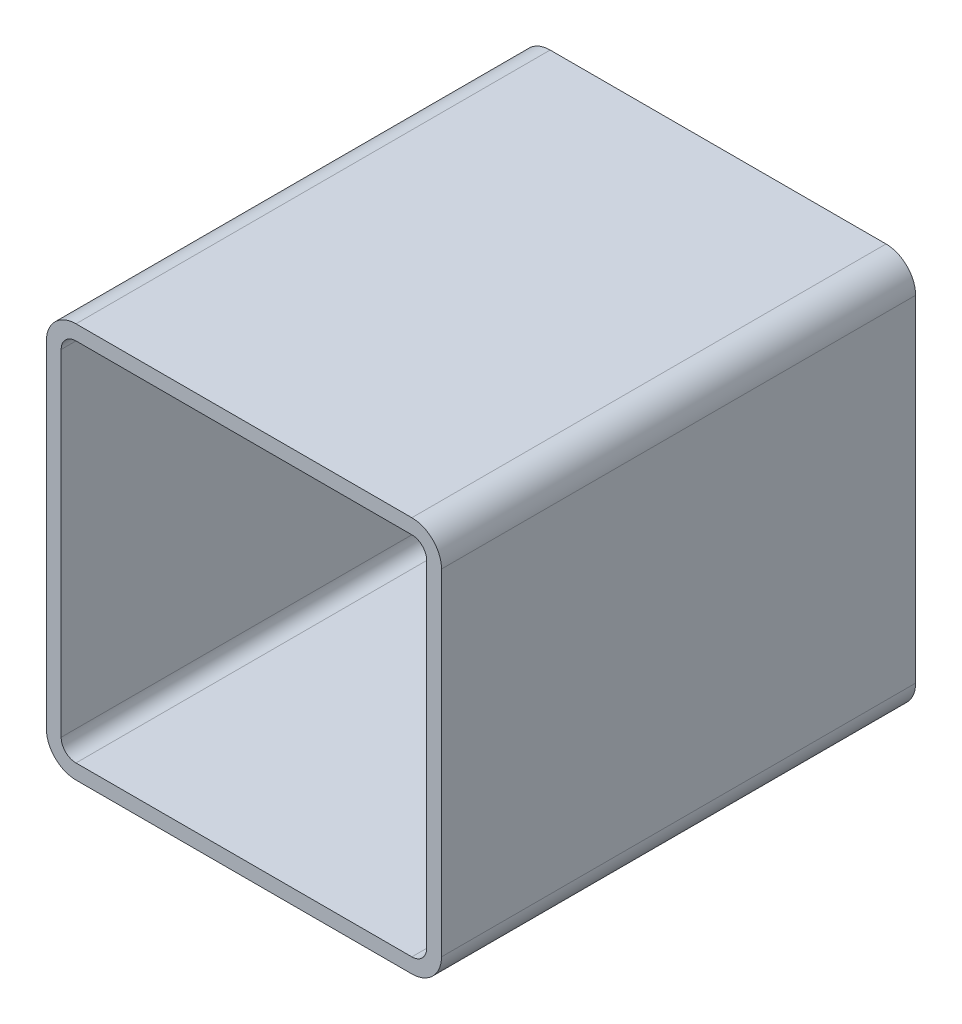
ISO-10303-21;
HEADER;
FILE_DESCRIPTION(('STEP AP214'),'2;1');
FILE_NAME('part.step','',(''),(''),'','','');
FILE_SCHEMA(('AUTOMOTIVE_DESIGN { 1 0 10303 214 1 1 1 1 }'));
ENDSEC;
DATA;
#1=APPLICATION_CONTEXT('core data for automotive mechanical design processes');
#2=APPLICATION_PROTOCOL_DEFINITION('international standard','automotive_design',2000,#1);
#3=PRODUCT_CONTEXT('',#1,'mechanical');
#4=PRODUCT('Part','Part','',(#3));
#5=PRODUCT_RELATED_PRODUCT_CATEGORY('part','',(#4));
#6=PRODUCT_DEFINITION_FORMATION('','',#4);
#7=PRODUCT_DEFINITION_CONTEXT('part definition',#1,'design');
#8=PRODUCT_DEFINITION('design','',#6,#7);
#9=PRODUCT_DEFINITION_SHAPE('','',#8);
#10=(LENGTH_UNIT() NAMED_UNIT(*) SI_UNIT(.MILLI.,.METRE.));
#11=(NAMED_UNIT(*) PLANE_ANGLE_UNIT() SI_UNIT($,.RADIAN.));
#12=(NAMED_UNIT(*) SI_UNIT($,.STERADIAN.) SOLID_ANGLE_UNIT());
#13=UNCERTAINTY_MEASURE_WITH_UNIT(LENGTH_MEASURE(1.E-05),#10,'distance_accuracy_value','');
#14=(GEOMETRIC_REPRESENTATION_CONTEXT(3) GLOBAL_UNCERTAINTY_ASSIGNED_CONTEXT((#13)) GLOBAL_UNIT_ASSIGNED_CONTEXT((#10,
#11,#12)) REPRESENTATION_CONTEXT('',''));
#15=CARTESIAN_POINT('',(0.,0.,0.));
#16=DIRECTION('',(0.,0.,1.));
#17=DIRECTION('',(1.,0.,0.));
#18=AXIS2_PLACEMENT_3D('',#15,#16,#17);
#19=CARTESIAN_POINT('',(21.7845794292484,236.870313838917,304.8));
#20=DIRECTION('',(0.,0.,1.));
#21=DIRECTION('',(1.,0.,0.));
#22=AXIS2_PLACEMENT_3D('',#19,#20,#21);
#23=PLANE('',#22);
#24=CARTESIAN_POINT('',(21.7845794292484,236.870313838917,304.8));
#25=DIRECTION('',(0.,0.,1.));
#26=DIRECTION('',(1.,0.,0.));
#27=AXIS2_PLACEMENT_3D('',#24,#25,#26);
#28=CIRCLE('',#27,19.05);
#29=CARTESIAN_POINT('',(21.7845794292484,255.920313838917,304.8));
#30=VERTEX_POINT('',#29);
#31=CARTESIAN_POINT('',(2.73457942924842,236.870313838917,304.8));
#32=VERTEX_POINT('',#31);
#33=EDGE_CURVE('E211',#30,#32,#28,.T.);
#34=ORIENTED_EDGE('',*,*,#33,.T.);
#35=DIRECTION('',(0.,-1.,0.));
#36=VECTOR('',#35,1.);
#37=CARTESIAN_POINT('',(2.73457942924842,20.9703138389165,304.8));
#38=LINE('',#37,#36);
#39=CARTESIAN_POINT('',(2.73457942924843,20.9703138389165,304.8));
#40=VERTEX_POINT('',#39);
#41=EDGE_CURVE('E214',#32,#40,#38,.T.);
#42=ORIENTED_EDGE('',*,*,#41,.T.);
#43=CARTESIAN_POINT('',(21.7845794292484,20.9703138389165,304.8));
#44=DIRECTION('',(0.,0.,1.));
#45=DIRECTION('',(1.,0.,0.));
#46=AXIS2_PLACEMENT_3D('',#43,#44,#45);
#47=CIRCLE('',#46,19.05);
#48=CARTESIAN_POINT('',(21.7845794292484,1.92031383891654,304.8));
#49=VERTEX_POINT('',#48);
#50=EDGE_CURVE('E217',#40,#49,#47,.T.);
#51=ORIENTED_EDGE('',*,*,#50,.T.);
#52=DIRECTION('',(1.,0.,0.));
#53=VECTOR('',#52,1.);
#54=CARTESIAN_POINT('',(237.684579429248,1.92031383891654,304.8));
#55=LINE('',#54,#53);
#56=CARTESIAN_POINT('',(237.684579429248,1.92031383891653,304.8));
#57=VERTEX_POINT('',#56);
#58=EDGE_CURVE('E219',#49,#57,#55,.T.);
#59=ORIENTED_EDGE('',*,*,#58,.T.);
#60=CARTESIAN_POINT('',(237.684579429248,20.9703138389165,304.8));
#61=DIRECTION('',(0.,0.,1.));
#62=DIRECTION('',(1.,0.,0.));
#63=AXIS2_PLACEMENT_3D('',#60,#61,#62);
#64=CIRCLE('',#63,19.05);
#65=CARTESIAN_POINT('',(256.734579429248,20.9703138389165,304.8));
#66=VERTEX_POINT('',#65);
#67=EDGE_CURVE('E221',#57,#66,#64,.T.);
#68=ORIENTED_EDGE('',*,*,#67,.T.);
#69=DIRECTION('',(0.,1.,0.));
#70=VECTOR('',#69,1.);
#71=CARTESIAN_POINT('',(256.734579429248,236.870313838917,304.8));
#72=LINE('',#71,#70);
#73=CARTESIAN_POINT('',(256.734579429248,236.870313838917,304.8));
#74=VERTEX_POINT('',#73);
#75=EDGE_CURVE('E223',#66,#74,#72,.T.);
#76=ORIENTED_EDGE('',*,*,#75,.T.);
#77=CARTESIAN_POINT('',(237.684579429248,236.870313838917,304.8));
#78=DIRECTION('',(0.,0.,1.));
#79=DIRECTION('',(1.,0.,0.));
#80=AXIS2_PLACEMENT_3D('',#77,#78,#79);
#81=CIRCLE('',#80,19.05);
#82=CARTESIAN_POINT('',(237.684579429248,255.920313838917,304.8));
#83=VERTEX_POINT('',#82);
#84=EDGE_CURVE('E225',#74,#83,#81,.T.);
#85=ORIENTED_EDGE('',*,*,#84,.T.);
#86=DIRECTION('',(-1.,0.,0.));
#87=VECTOR('',#86,1.);
#88=CARTESIAN_POINT('',(21.7845794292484,255.920313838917,304.8));
#89=LINE('',#88,#87);
#90=EDGE_CURVE('E227',#83,#30,#89,.T.);
#91=ORIENTED_EDGE('',*,*,#90,.T.);
#92=EDGE_LOOP('',(#34,#42,#51,#59,#68,#76,#85,#91));
#93=FACE_BOUND('',#92,.T.);
#94=DIRECTION('',(0.,-1.,0.));
#95=VECTOR('',#94,1.);
#96=CARTESIAN_POINT('',(12.2595794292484,20.9703138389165,304.8));
#97=LINE('',#96,#95);
#98=CARTESIAN_POINT('',(12.2595794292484,236.870313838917,304.8));
#99=VERTEX_POINT('',#98);
#100=CARTESIAN_POINT('',(12.2595794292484,20.9703138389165,304.8));
#101=VERTEX_POINT('',#100);
#102=EDGE_CURVE('E154',#99,#101,#97,.T.);
#103=ORIENTED_EDGE('',*,*,#102,.F.);
#104=CARTESIAN_POINT('',(21.7845794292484,236.870313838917,304.8));
#105=DIRECTION('',(0.,0.,1.));
#106=DIRECTION('',(1.,0.,0.));
#107=AXIS2_PLACEMENT_3D('',#104,#105,#106);
#108=CIRCLE('',#107,9.52500000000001);
#109=CARTESIAN_POINT('',(21.7845794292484,246.395313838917,304.8));
#110=VERTEX_POINT('',#109);
#111=EDGE_CURVE('E146',#110,#99,#108,.T.);
#112=ORIENTED_EDGE('',*,*,#111,.F.);
#113=DIRECTION('',(-1.,0.,0.));
#114=VECTOR('',#113,1.);
#115=CARTESIAN_POINT('',(21.7845794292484,246.395313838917,304.8));
#116=LINE('',#115,#114);
#117=CARTESIAN_POINT('',(237.684579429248,246.395313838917,304.8));
#118=VERTEX_POINT('',#117);
#119=EDGE_CURVE('E179',#118,#110,#116,.T.);
#120=ORIENTED_EDGE('',*,*,#119,.F.);
#121=CARTESIAN_POINT('',(237.684579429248,236.870313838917,304.8));
#122=DIRECTION('',(0.,0.,1.));
#123=DIRECTION('',(1.,0.,0.));
#124=AXIS2_PLACEMENT_3D('',#121,#122,#123);
#125=CIRCLE('',#124,9.52500000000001);
#126=CARTESIAN_POINT('',(247.209579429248,236.870313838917,304.8));
#127=VERTEX_POINT('',#126);
#128=EDGE_CURVE('E177',#127,#118,#125,.T.);
#129=ORIENTED_EDGE('',*,*,#128,.F.);
#130=DIRECTION('',(0.,1.,0.));
#131=VECTOR('',#130,1.);
#132=CARTESIAN_POINT('',(247.209579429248,236.870313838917,304.8));
#133=LINE('',#132,#131);
#134=CARTESIAN_POINT('',(247.209579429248,20.9703138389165,304.8));
#135=VERTEX_POINT('',#134);
#136=EDGE_CURVE('E175',#135,#127,#133,.T.);
#137=ORIENTED_EDGE('',*,*,#136,.F.);
#138=CARTESIAN_POINT('',(237.684579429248,20.9703138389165,304.8));
#139=DIRECTION('',(0.,0.,1.));
#140=DIRECTION('',(1.,0.,0.));
#141=AXIS2_PLACEMENT_3D('',#138,#139,#140);
#142=CIRCLE('',#141,9.52500000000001);
#143=CARTESIAN_POINT('',(237.684579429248,11.4453138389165,304.8));
#144=VERTEX_POINT('',#143);
#145=EDGE_CURVE('E173',#144,#135,#142,.T.);
#146=ORIENTED_EDGE('',*,*,#145,.F.);
#147=DIRECTION('',(1.,0.,0.));
#148=VECTOR('',#147,1.);
#149=CARTESIAN_POINT('',(237.684579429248,11.4453138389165,304.8));
#150=LINE('',#149,#148);
#151=CARTESIAN_POINT('',(21.7845794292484,11.4453138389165,304.8));
#152=VERTEX_POINT('',#151);
#153=EDGE_CURVE('E169',#152,#144,#150,.T.);
#154=ORIENTED_EDGE('',*,*,#153,.F.);
#155=CARTESIAN_POINT('',(21.7845794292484,20.9703138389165,304.8));
#156=DIRECTION('',(0.,0.,1.));
#157=DIRECTION('',(1.,0.,0.));
#158=AXIS2_PLACEMENT_3D('',#155,#156,#157);
#159=CIRCLE('',#158,9.525);
#160=EDGE_CURVE('E167',#101,#152,#159,.T.);
#161=ORIENTED_EDGE('',*,*,#160,.F.);
#162=EDGE_LOOP('',(#103,#112,#120,#129,#137,#146,#154,#161));
#163=FACE_BOUND('',#162,.T.);
#164=ADVANCED_FACE('F33',(#93,#163),#23,.T.);
#165=CARTESIAN_POINT('',(21.7845794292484,236.870313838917,0.));
#166=DIRECTION('',(0.,0.,1.));
#167=DIRECTION('',(1.,0.,0.));
#168=AXIS2_PLACEMENT_3D('',#165,#166,#167);
#169=PLANE('',#168);
#170=CARTESIAN_POINT('',(21.7845794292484,236.870313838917,0.));
#171=DIRECTION('',(0.,0.,1.));
#172=DIRECTION('',(1.,0.,0.));
#173=AXIS2_PLACEMENT_3D('',#170,#171,#172);
#174=CIRCLE('',#173,19.05);
#175=CARTESIAN_POINT('',(21.7845794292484,255.920313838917,0.));
#176=VERTEX_POINT('',#175);
#177=CARTESIAN_POINT('',(2.73457942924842,236.870313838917,0.));
#178=VERTEX_POINT('',#177);
#179=EDGE_CURVE('E162',#176,#178,#174,.T.);
#180=ORIENTED_EDGE('',*,*,#179,.F.);
#181=DIRECTION('',(-1.,0.,0.));
#182=VECTOR('',#181,1.);
#183=CARTESIAN_POINT('',(21.7845794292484,255.920313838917,0.));
#184=LINE('',#183,#182);
#185=CARTESIAN_POINT('',(237.684579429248,255.920313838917,0.));
#186=VERTEX_POINT('',#185);
#187=EDGE_CURVE('E215',#186,#176,#184,.T.);
#188=ORIENTED_EDGE('',*,*,#187,.F.);
#189=CARTESIAN_POINT('',(237.684579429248,236.870313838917,0.));
#190=DIRECTION('',(0.,0.,1.));
#191=DIRECTION('',(1.,0.,0.));
#192=AXIS2_PLACEMENT_3D('',#189,#190,#191);
#193=CIRCLE('',#192,19.05);
#194=CARTESIAN_POINT('',(256.734579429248,236.870313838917,0.));
#195=VERTEX_POINT('',#194);
#196=EDGE_CURVE('E242',#195,#186,#193,.T.);
#197=ORIENTED_EDGE('',*,*,#196,.F.);
#198=DIRECTION('',(0.,1.,0.));
#199=VECTOR('',#198,1.);
#200=CARTESIAN_POINT('',(256.734579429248,236.870313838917,0.));
#201=LINE('',#200,#199);
#202=CARTESIAN_POINT('',(256.734579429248,20.9703138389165,0.));
#203=VERTEX_POINT('',#202);
#204=EDGE_CURVE('E240',#203,#195,#201,.T.);
#205=ORIENTED_EDGE('',*,*,#204,.F.);
#206=CARTESIAN_POINT('',(237.684579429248,20.9703138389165,0.));
#207=DIRECTION('',(0.,0.,1.));
#208=DIRECTION('',(1.,0.,0.));
#209=AXIS2_PLACEMENT_3D('',#206,#207,#208);
#210=CIRCLE('',#209,19.05);
#211=CARTESIAN_POINT('',(237.684579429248,1.92031383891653,0.));
#212=VERTEX_POINT('',#211);
#213=EDGE_CURVE('E238',#212,#203,#210,.T.);
#214=ORIENTED_EDGE('',*,*,#213,.F.);
#215=DIRECTION('',(1.,0.,0.));
#216=VECTOR('',#215,1.);
#217=CARTESIAN_POINT('',(237.684579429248,1.92031383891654,0.));
#218=LINE('',#217,#216);
#219=CARTESIAN_POINT('',(21.7845794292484,1.92031383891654,0.));
#220=VERTEX_POINT('',#219);
#221=EDGE_CURVE('E236',#220,#212,#218,.T.);
#222=ORIENTED_EDGE('',*,*,#221,.F.);
#223=CARTESIAN_POINT('',(21.7845794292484,20.9703138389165,0.));
#224=DIRECTION('',(0.,0.,1.));
#225=DIRECTION('',(1.,0.,0.));
#226=AXIS2_PLACEMENT_3D('',#223,#224,#225);
#227=CIRCLE('',#226,19.05);
#228=CARTESIAN_POINT('',(2.73457942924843,20.9703138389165,0.));
#229=VERTEX_POINT('',#228);
#230=EDGE_CURVE('E234',#229,#220,#227,.T.);
#231=ORIENTED_EDGE('',*,*,#230,.F.);
#232=DIRECTION('',(0.,-1.,0.));
#233=VECTOR('',#232,1.);
#234=CARTESIAN_POINT('',(2.73457942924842,20.9703138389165,0.));
#235=LINE('',#234,#233);
#236=EDGE_CURVE('E232',#178,#229,#235,.T.);
#237=ORIENTED_EDGE('',*,*,#236,.F.);
#238=EDGE_LOOP('',(#180,#188,#197,#205,#214,#222,#231,#237));
#239=FACE_BOUND('',#238,.T.);
#240=CARTESIAN_POINT('',(21.7845794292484,236.870313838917,0.));
#241=DIRECTION('',(0.,0.,1.));
#242=DIRECTION('',(1.,0.,0.));
#243=AXIS2_PLACEMENT_3D('',#240,#241,#242);
#244=CIRCLE('',#243,9.52500000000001);
#245=CARTESIAN_POINT('',(21.7845794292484,246.395313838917,0.));
#246=VERTEX_POINT('',#245);
#247=CARTESIAN_POINT('',(12.2595794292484,236.870313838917,0.));
#248=VERTEX_POINT('',#247);
#249=EDGE_CURVE('E56',#246,#248,#244,.T.);
#250=ORIENTED_EDGE('',*,*,#249,.T.);
#251=DIRECTION('',(0.,-1.,0.));
#252=VECTOR('',#251,1.);
#253=CARTESIAN_POINT('',(12.2595794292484,20.9703138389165,0.));
#254=LINE('',#253,#252);
#255=CARTESIAN_POINT('',(12.2595794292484,20.9703138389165,0.));
#256=VERTEX_POINT('',#255);
#257=EDGE_CURVE('E161',#248,#256,#254,.T.);
#258=ORIENTED_EDGE('',*,*,#257,.T.);
#259=CARTESIAN_POINT('',(21.7845794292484,20.9703138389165,0.));
#260=DIRECTION('',(0.,0.,1.));
#261=DIRECTION('',(1.,0.,0.));
#262=AXIS2_PLACEMENT_3D('',#259,#260,#261);
#263=CIRCLE('',#262,9.525);
#264=CARTESIAN_POINT('',(21.7845794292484,11.4453138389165,0.));
#265=VERTEX_POINT('',#264);
#266=EDGE_CURVE('E183',#256,#265,#263,.T.);
#267=ORIENTED_EDGE('',*,*,#266,.T.);
#268=DIRECTION('',(1.,0.,0.));
#269=VECTOR('',#268,1.);
#270=CARTESIAN_POINT('',(237.684579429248,11.4453138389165,0.));
#271=LINE('',#270,#269);
#272=CARTESIAN_POINT('',(237.684579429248,11.4453138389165,0.));
#273=VERTEX_POINT('',#272);
#274=EDGE_CURVE('E186',#265,#273,#271,.T.);
#275=ORIENTED_EDGE('',*,*,#274,.T.);
#276=CARTESIAN_POINT('',(237.684579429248,20.9703138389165,0.));
#277=DIRECTION('',(0.,0.,1.));
#278=DIRECTION('',(1.,0.,0.));
#279=AXIS2_PLACEMENT_3D('',#276,#277,#278);
#280=CIRCLE('',#279,9.52500000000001);
#281=CARTESIAN_POINT('',(247.209579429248,20.9703138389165,0.));
#282=VERTEX_POINT('',#281);
#283=EDGE_CURVE('E189',#273,#282,#280,.T.);
#284=ORIENTED_EDGE('',*,*,#283,.T.);
#285=DIRECTION('',(0.,1.,0.));
#286=VECTOR('',#285,1.);
#287=CARTESIAN_POINT('',(247.209579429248,236.870313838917,0.));
#288=LINE('',#287,#286);
#289=CARTESIAN_POINT('',(247.209579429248,236.870313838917,0.));
#290=VERTEX_POINT('',#289);
#291=EDGE_CURVE('E192',#282,#290,#288,.T.);
#292=ORIENTED_EDGE('',*,*,#291,.T.);
#293=CARTESIAN_POINT('',(237.684579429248,236.870313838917,0.));
#294=DIRECTION('',(0.,0.,1.));
#295=DIRECTION('',(1.,0.,0.));
#296=AXIS2_PLACEMENT_3D('',#293,#294,#295);
#297=CIRCLE('',#296,9.52500000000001);
#298=CARTESIAN_POINT('',(237.684579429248,246.395313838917,0.));
#299=VERTEX_POINT('',#298);
#300=EDGE_CURVE('E195',#290,#299,#297,.T.);
#301=ORIENTED_EDGE('',*,*,#300,.T.);
#302=DIRECTION('',(-1.,0.,0.));
#303=VECTOR('',#302,1.);
#304=CARTESIAN_POINT('',(21.7845794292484,246.395313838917,0.));
#305=LINE('',#304,#303);
#306=EDGE_CURVE('E155',#299,#246,#305,.T.);
#307=ORIENTED_EDGE('',*,*,#306,.T.);
#308=EDGE_LOOP('',(#250,#258,#267,#275,#284,#292,#301,#307));
#309=FACE_BOUND('',#308,.T.);
#310=ADVANCED_FACE('F272',(#239,#309),#169,.F.);
#311=CARTESIAN_POINT('',(21.7845794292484,236.870313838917,304.8));
#312=DIRECTION('',(0.,0.,-1.));
#313=DIRECTION('',(-1.,0.,0.));
#314=AXIS2_PLACEMENT_3D('',#311,#312,#313);
#315=CYLINDRICAL_SURFACE('',#314,19.05);
#316=ORIENTED_EDGE('',*,*,#179,.T.);
#317=DIRECTION('',(0.,0.,-1.));
#318=VECTOR('',#317,1.);
#319=CARTESIAN_POINT('',(2.73457942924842,236.870313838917,304.8));
#320=LINE('',#319,#318);
#321=EDGE_CURVE('E11',#32,#178,#320,.T.);
#322=ORIENTED_EDGE('',*,*,#321,.F.);
#323=ORIENTED_EDGE('',*,*,#33,.F.);
#324=DIRECTION('',(0.,0.,-1.));
#325=VECTOR('',#324,1.);
#326=CARTESIAN_POINT('',(21.7845794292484,255.920313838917,304.8));
#327=LINE('',#326,#325);
#328=EDGE_CURVE('E229',#30,#176,#327,.T.);
#329=ORIENTED_EDGE('',*,*,#328,.T.);
#330=EDGE_LOOP('',(#316,#322,#323,#329));
#331=FACE_BOUND('',#330,.T.);
#332=ADVANCED_FACE('F35',(#331),#315,.T.);
#333=CARTESIAN_POINT('',(2.73457942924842,20.9703138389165,304.8));
#334=DIRECTION('',(1.,0.,0.));
#335=DIRECTION('',(0.,0.,-1.));
#336=AXIS2_PLACEMENT_3D('',#333,#334,#335);
#337=PLANE('',#336);
#338=ORIENTED_EDGE('',*,*,#236,.T.);
#339=DIRECTION('',(0.,0.,-1.));
#340=VECTOR('',#339,1.);
#341=CARTESIAN_POINT('',(2.73457942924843,20.9703138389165,304.8));
#342=LINE('',#341,#340);
#343=EDGE_CURVE('E41',#40,#229,#342,.T.);
#344=ORIENTED_EDGE('',*,*,#343,.F.);
#345=ORIENTED_EDGE('',*,*,#41,.F.);
#346=ORIENTED_EDGE('',*,*,#321,.T.);
#347=EDGE_LOOP('',(#338,#344,#345,#346));
#348=FACE_BOUND('',#347,.T.);
#349=ADVANCED_FACE('F289',(#348),#337,.F.);
#350=CARTESIAN_POINT('',(21.7845794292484,20.9703138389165,304.8));
#351=DIRECTION('',(0.,0.,-1.));
#352=DIRECTION('',(-1.,0.,0.));
#353=AXIS2_PLACEMENT_3D('',#350,#351,#352);
#354=CYLINDRICAL_SURFACE('',#353,19.05);
#355=ORIENTED_EDGE('',*,*,#230,.T.);
#356=DIRECTION('',(0.,0.,-1.));
#357=VECTOR('',#356,1.);
#358=CARTESIAN_POINT('',(21.7845794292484,1.92031383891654,304.8));
#359=LINE('',#358,#357);
#360=EDGE_CURVE('E259',#49,#220,#359,.T.);
#361=ORIENTED_EDGE('',*,*,#360,.F.);
#362=ORIENTED_EDGE('',*,*,#50,.F.);
#363=ORIENTED_EDGE('',*,*,#343,.T.);
#364=EDGE_LOOP('',(#355,#361,#362,#363));
#365=FACE_BOUND('',#364,.T.);
#366=ADVANCED_FACE('F266',(#365),#354,.T.);
#367=CARTESIAN_POINT('',(237.684579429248,1.92031383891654,304.8));
#368=DIRECTION('',(0.,1.,0.));
#369=DIRECTION('',(0.,0.,1.));
#370=AXIS2_PLACEMENT_3D('',#367,#368,#369);
#371=PLANE('',#370);
#372=ORIENTED_EDGE('',*,*,#221,.T.);
#373=DIRECTION('',(0.,0.,-1.));
#374=VECTOR('',#373,1.);
#375=CARTESIAN_POINT('',(237.684579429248,1.92031383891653,304.8));
#376=LINE('',#375,#374);
#377=EDGE_CURVE('E256',#57,#212,#376,.T.);
#378=ORIENTED_EDGE('',*,*,#377,.F.);
#379=ORIENTED_EDGE('',*,*,#58,.F.);
#380=ORIENTED_EDGE('',*,*,#360,.T.);
#381=EDGE_LOOP('',(#372,#378,#379,#380));
#382=FACE_BOUND('',#381,.T.);
#383=ADVANCED_FACE('F278',(#382),#371,.F.);
#384=CARTESIAN_POINT('',(237.684579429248,20.9703138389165,304.8));
#385=DIRECTION('',(0.,0.,-1.));
#386=DIRECTION('',(-1.,0.,0.));
#387=AXIS2_PLACEMENT_3D('',#384,#385,#386);
#388=CYLINDRICAL_SURFACE('',#387,19.05);
#389=ORIENTED_EDGE('',*,*,#213,.T.);
#390=DIRECTION('',(0.,0.,-1.));
#391=VECTOR('',#390,1.);
#392=CARTESIAN_POINT('',(256.734579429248,20.9703138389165,304.8));
#393=LINE('',#392,#391);
#394=EDGE_CURVE('E253',#66,#203,#393,.T.);
#395=ORIENTED_EDGE('',*,*,#394,.F.);
#396=ORIENTED_EDGE('',*,*,#67,.F.);
#397=ORIENTED_EDGE('',*,*,#377,.T.);
#398=EDGE_LOOP('',(#389,#395,#396,#397));
#399=FACE_BOUND('',#398,.T.);
#400=ADVANCED_FACE('F282',(#399),#388,.T.);
#401=CARTESIAN_POINT('',(256.734579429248,236.870313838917,304.8));
#402=DIRECTION('',(-1.,0.,0.));
#403=DIRECTION('',(0.,0.,1.));
#404=AXIS2_PLACEMENT_3D('',#401,#402,#403);
#405=PLANE('',#404);
#406=ORIENTED_EDGE('',*,*,#204,.T.);
#407=DIRECTION('',(0.,0.,-1.));
#408=VECTOR('',#407,1.);
#409=CARTESIAN_POINT('',(256.734579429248,236.870313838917,304.8));
#410=LINE('',#409,#408);
#411=EDGE_CURVE('E250',#74,#195,#410,.T.);
#412=ORIENTED_EDGE('',*,*,#411,.F.);
#413=ORIENTED_EDGE('',*,*,#75,.F.);
#414=ORIENTED_EDGE('',*,*,#394,.T.);
#415=EDGE_LOOP('',(#406,#412,#413,#414));
#416=FACE_BOUND('',#415,.T.);
#417=ADVANCED_FACE('F302',(#416),#405,.F.);
#418=CARTESIAN_POINT('',(237.684579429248,236.870313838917,304.8));
#419=DIRECTION('',(0.,0.,-1.));
#420=DIRECTION('',(-1.,0.,0.));
#421=AXIS2_PLACEMENT_3D('',#418,#419,#420);
#422=CYLINDRICAL_SURFACE('',#421,19.05);
#423=ORIENTED_EDGE('',*,*,#196,.T.);
#424=DIRECTION('',(0.,0.,-1.));
#425=VECTOR('',#424,1.);
#426=CARTESIAN_POINT('',(237.684579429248,255.920313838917,304.8));
#427=LINE('',#426,#425);
#428=EDGE_CURVE('E247',#83,#186,#427,.T.);
#429=ORIENTED_EDGE('',*,*,#428,.F.);
#430=ORIENTED_EDGE('',*,*,#84,.F.);
#431=ORIENTED_EDGE('',*,*,#411,.T.);
#432=EDGE_LOOP('',(#423,#429,#430,#431));
#433=FACE_BOUND('',#432,.T.);
#434=ADVANCED_FACE('F300',(#433),#422,.T.);
#435=CARTESIAN_POINT('',(21.7845794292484,255.920313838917,304.8));
#436=DIRECTION('',(0.,-1.,0.));
#437=DIRECTION('',(0.,0.,-1.));
#438=AXIS2_PLACEMENT_3D('',#435,#436,#437);
#439=PLANE('',#438);
#440=ORIENTED_EDGE('',*,*,#187,.T.);
#441=ORIENTED_EDGE('',*,*,#328,.F.);
#442=ORIENTED_EDGE('',*,*,#90,.F.);
#443=ORIENTED_EDGE('',*,*,#428,.T.);
#444=EDGE_LOOP('',(#440,#441,#442,#443));
#445=FACE_BOUND('',#444,.T.);
#446=ADVANCED_FACE('F295',(#445),#439,.F.);
#447=CARTESIAN_POINT('',(21.7845794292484,236.870313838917,304.8));
#448=DIRECTION('',(0.,0.,-1.));
#449=DIRECTION('',(-1.,0.,0.));
#450=AXIS2_PLACEMENT_3D('',#447,#448,#449);
#451=CYLINDRICAL_SURFACE('',#450,9.52500000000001);
#452=ORIENTED_EDGE('',*,*,#249,.F.);
#453=DIRECTION('',(0.,0.,-1.));
#454=VECTOR('',#453,1.);
#455=CARTESIAN_POINT('',(21.7845794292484,246.395313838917,304.8));
#456=LINE('',#455,#454);
#457=EDGE_CURVE('E150',#110,#246,#456,.T.);
#458=ORIENTED_EDGE('',*,*,#457,.F.);
#459=ORIENTED_EDGE('',*,*,#111,.T.);
#460=DIRECTION('',(0.,0.,-1.));
#461=VECTOR('',#460,1.);
#462=CARTESIAN_POINT('',(12.2595794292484,236.870313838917,304.8));
#463=LINE('',#462,#461);
#464=EDGE_CURVE('E149',#99,#248,#463,.T.);
#465=ORIENTED_EDGE('',*,*,#464,.T.);
#466=EDGE_LOOP('',(#452,#458,#459,#465));
#467=FACE_BOUND('',#466,.T.);
#468=ADVANCED_FACE('F148',(#467),#451,.F.);
#469=CARTESIAN_POINT('',(12.2595794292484,20.9703138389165,304.8));
#470=DIRECTION('',(1.,0.,0.));
#471=DIRECTION('',(0.,0.,-1.));
#472=AXIS2_PLACEMENT_3D('',#469,#470,#471);
#473=PLANE('',#472);
#474=ORIENTED_EDGE('',*,*,#257,.F.);
#475=ORIENTED_EDGE('',*,*,#464,.F.);
#476=ORIENTED_EDGE('',*,*,#102,.T.);
#477=DIRECTION('',(0.,0.,-1.));
#478=VECTOR('',#477,1.);
#479=CARTESIAN_POINT('',(12.2595794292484,20.9703138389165,304.8));
#480=LINE('',#479,#478);
#481=EDGE_CURVE('E163',#101,#256,#480,.T.);
#482=ORIENTED_EDGE('',*,*,#481,.T.);
#483=EDGE_LOOP('',(#474,#475,#476,#482));
#484=FACE_BOUND('',#483,.T.);
#485=ADVANCED_FACE('F158',(#484),#473,.T.);
#486=CARTESIAN_POINT('',(21.7845794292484,20.9703138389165,304.8));
#487=DIRECTION('',(0.,0.,-1.));
#488=DIRECTION('',(-1.,0.,0.));
#489=AXIS2_PLACEMENT_3D('',#486,#487,#488);
#490=CYLINDRICAL_SURFACE('',#489,9.525);
#491=ORIENTED_EDGE('',*,*,#266,.F.);
#492=ORIENTED_EDGE('',*,*,#481,.F.);
#493=ORIENTED_EDGE('',*,*,#160,.T.);
#494=DIRECTION('',(0.,0.,-1.));
#495=VECTOR('',#494,1.);
#496=CARTESIAN_POINT('',(21.7845794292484,11.4453138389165,304.8));
#497=LINE('',#496,#495);
#498=EDGE_CURVE('E208',#152,#265,#497,.T.);
#499=ORIENTED_EDGE('',*,*,#498,.T.);
#500=EDGE_LOOP('',(#491,#492,#493,#499));
#501=FACE_BOUND('',#500,.T.);
#502=ADVANCED_FACE('F327',(#501),#490,.F.);
#503=CARTESIAN_POINT('',(237.684579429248,11.4453138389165,304.8));
#504=DIRECTION('',(0.,1.,0.));
#505=DIRECTION('',(0.,0.,1.));
#506=AXIS2_PLACEMENT_3D('',#503,#504,#505);
#507=PLANE('',#506);
#508=ORIENTED_EDGE('',*,*,#274,.F.);
#509=ORIENTED_EDGE('',*,*,#498,.F.);
#510=ORIENTED_EDGE('',*,*,#153,.T.);
#511=DIRECTION('',(0.,0.,-1.));
#512=VECTOR('',#511,1.);
#513=CARTESIAN_POINT('',(237.684579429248,11.4453138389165,304.8));
#514=LINE('',#513,#512);
#515=EDGE_CURVE('E206',#144,#273,#514,.T.);
#516=ORIENTED_EDGE('',*,*,#515,.T.);
#517=EDGE_LOOP('',(#508,#509,#510,#516));
#518=FACE_BOUND('',#517,.T.);
#519=ADVANCED_FACE('F331',(#518),#507,.T.);
#520=CARTESIAN_POINT('',(237.684579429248,20.9703138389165,304.8));
#521=DIRECTION('',(0.,0.,-1.));
#522=DIRECTION('',(-1.,0.,0.));
#523=AXIS2_PLACEMENT_3D('',#520,#521,#522);
#524=CYLINDRICAL_SURFACE('',#523,9.52500000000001);
#525=ORIENTED_EDGE('',*,*,#283,.F.);
#526=ORIENTED_EDGE('',*,*,#515,.F.);
#527=ORIENTED_EDGE('',*,*,#145,.T.);
#528=DIRECTION('',(0.,0.,-1.));
#529=VECTOR('',#528,1.);
#530=CARTESIAN_POINT('',(247.209579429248,20.9703138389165,304.8));
#531=LINE('',#530,#529);
#532=EDGE_CURVE('E204',#135,#282,#531,.T.);
#533=ORIENTED_EDGE('',*,*,#532,.T.);
#534=EDGE_LOOP('',(#525,#526,#527,#533));
#535=FACE_BOUND('',#534,.T.);
#536=ADVANCED_FACE('F337',(#535),#524,.F.);
#537=CARTESIAN_POINT('',(247.209579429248,236.870313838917,304.8));
#538=DIRECTION('',(-1.,0.,0.));
#539=DIRECTION('',(0.,0.,1.));
#540=AXIS2_PLACEMENT_3D('',#537,#538,#539);
#541=PLANE('',#540);
#542=ORIENTED_EDGE('',*,*,#291,.F.);
#543=ORIENTED_EDGE('',*,*,#532,.F.);
#544=ORIENTED_EDGE('',*,*,#136,.T.);
#545=DIRECTION('',(0.,0.,-1.));
#546=VECTOR('',#545,1.);
#547=CARTESIAN_POINT('',(247.209579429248,236.870313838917,304.8));
#548=LINE('',#547,#546);
#549=EDGE_CURVE('E202',#127,#290,#548,.T.);
#550=ORIENTED_EDGE('',*,*,#549,.T.);
#551=EDGE_LOOP('',(#542,#543,#544,#550));
#552=FACE_BOUND('',#551,.T.);
#553=ADVANCED_FACE('F341',(#552),#541,.T.);
#554=CARTESIAN_POINT('',(237.684579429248,236.870313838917,304.8));
#555=DIRECTION('',(0.,0.,-1.));
#556=DIRECTION('',(-1.,0.,0.));
#557=AXIS2_PLACEMENT_3D('',#554,#555,#556);
#558=CYLINDRICAL_SURFACE('',#557,9.52500000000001);
#559=ORIENTED_EDGE('',*,*,#300,.F.);
#560=ORIENTED_EDGE('',*,*,#549,.F.);
#561=ORIENTED_EDGE('',*,*,#128,.T.);
#562=DIRECTION('',(0.,0.,-1.));
#563=VECTOR('',#562,1.);
#564=CARTESIAN_POINT('',(237.684579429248,246.395313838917,304.8));
#565=LINE('',#564,#563);
#566=EDGE_CURVE('E48',#118,#299,#565,.T.);
#567=ORIENTED_EDGE('',*,*,#566,.T.);
#568=EDGE_LOOP('',(#559,#560,#561,#567));
#569=FACE_BOUND('',#568,.T.);
#570=ADVANCED_FACE('F345',(#569),#558,.F.);
#571=CARTESIAN_POINT('',(21.7845794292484,246.395313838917,304.8));
#572=DIRECTION('',(0.,-1.,0.));
#573=DIRECTION('',(0.,0.,-1.));
#574=AXIS2_PLACEMENT_3D('',#571,#572,#573);
#575=PLANE('',#574);
#576=ORIENTED_EDGE('',*,*,#306,.F.);
#577=ORIENTED_EDGE('',*,*,#566,.F.);
#578=ORIENTED_EDGE('',*,*,#119,.T.);
#579=ORIENTED_EDGE('',*,*,#457,.T.);
#580=EDGE_LOOP('',(#576,#577,#578,#579));
#581=FACE_BOUND('',#580,.T.);
#582=ADVANCED_FACE('F349',(#581),#575,.T.);
#583=CLOSED_SHELL('',(#164,#310,#332,#349,#366,#383,#400,#417,#434,#446,#468,#485,#502,#519,
#536,#553,#570,#582));
#584=MANIFOLD_SOLID_BREP('B2',#583);
#585=ADVANCED_BREP_SHAPE_REPRESENTATION('',(#18,#584),#14);
#586=SHAPE_DEFINITION_REPRESENTATION(#9,#585);
ENDSEC;
END-ISO-10303-21;
